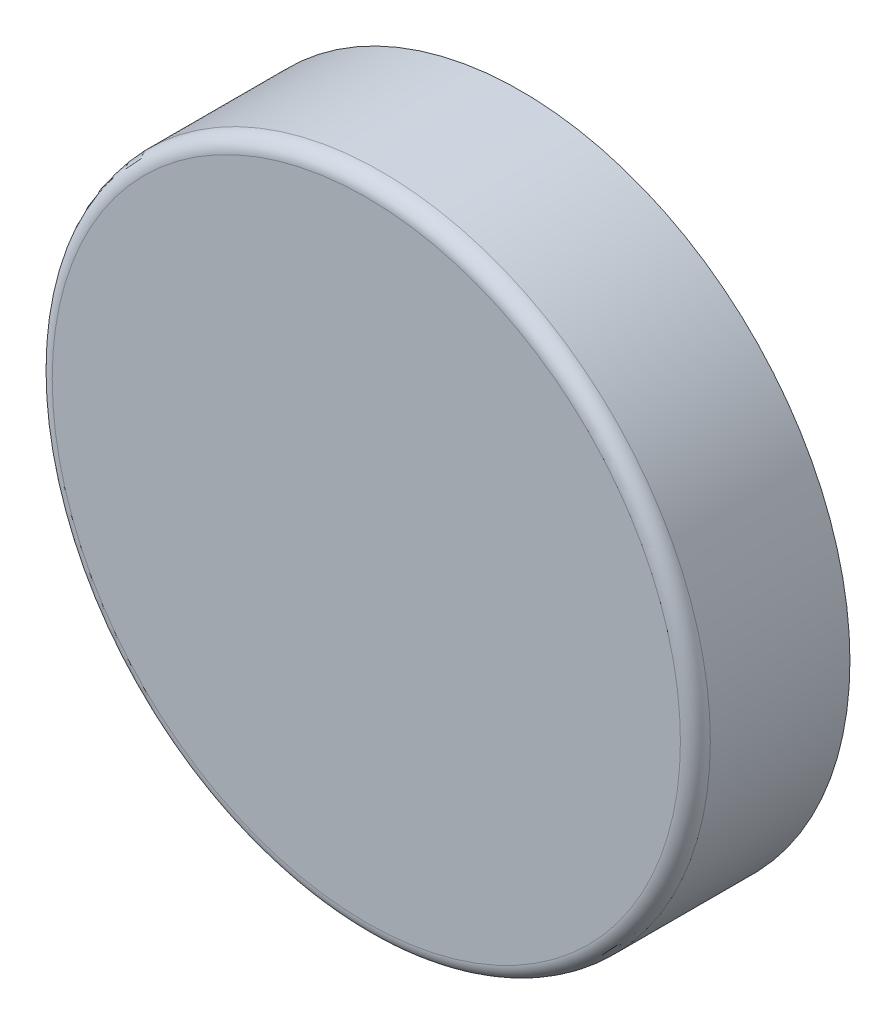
ISO-10303-21;
HEADER;
FILE_DESCRIPTION(('STEP AP214'),'2;1');
FILE_NAME('part.step','',(''),(''),'','','');
FILE_SCHEMA(('AUTOMOTIVE_DESIGN { 1 0 10303 214 1 1 1 1 }'));
ENDSEC;
DATA;
#1=APPLICATION_CONTEXT('core data for automotive mechanical design processes');
#2=APPLICATION_PROTOCOL_DEFINITION('international standard','automotive_design',2000,#1);
#3=PRODUCT_CONTEXT('',#1,'mechanical');
#4=PRODUCT('Part','Part','',(#3));
#5=PRODUCT_RELATED_PRODUCT_CATEGORY('part','',(#4));
#6=PRODUCT_DEFINITION_FORMATION('','',#4);
#7=PRODUCT_DEFINITION_CONTEXT('part definition',#1,'design');
#8=PRODUCT_DEFINITION('design','',#6,#7);
#9=PRODUCT_DEFINITION_SHAPE('','',#8);
#10=(LENGTH_UNIT() NAMED_UNIT(*) SI_UNIT(.MILLI.,.METRE.));
#11=(NAMED_UNIT(*) PLANE_ANGLE_UNIT() SI_UNIT($,.RADIAN.));
#12=(NAMED_UNIT(*) SI_UNIT($,.STERADIAN.) SOLID_ANGLE_UNIT());
#13=UNCERTAINTY_MEASURE_WITH_UNIT(LENGTH_MEASURE(1.E-05),#10,'distance_accuracy_value','');
#14=(GEOMETRIC_REPRESENTATION_CONTEXT(3) GLOBAL_UNCERTAINTY_ASSIGNED_CONTEXT((#13)) GLOBAL_UNIT_ASSIGNED_CONTEXT((#10,
#11,#12)) REPRESENTATION_CONTEXT('',''));
#15=CARTESIAN_POINT('',(0.,0.,0.));
#16=DIRECTION('',(0.,0.,1.));
#17=DIRECTION('',(1.,0.,0.));
#18=AXIS2_PLACEMENT_3D('',#15,#16,#17);
#19=CARTESIAN_POINT('',(0.,0.,3.1));
#20=DIRECTION('',(0.,0.,-1.));
#21=DIRECTION('',(-1.,0.,0.));
#22=AXIS2_PLACEMENT_3D('',#19,#20,#21);
#23=CYLINDRICAL_SURFACE('',#22,6.6);
#24=CARTESIAN_POINT('',(0.,0.,2.8));
#25=DIRECTION('',(0.,0.,1.));
#26=DIRECTION('',(1.,0.,0.));
#27=AXIS2_PLACEMENT_3D('',#24,#25,#26);
#28=CIRCLE('',#27,6.6);
#29=CARTESIAN_POINT('',(-6.6,0.,2.8));
#30=VERTEX_POINT('',#29);
#31=EDGE_CURVE('E10',#30,#30,#28,.F.);
#32=CARTESIAN_POINT('',(0.,0.,0.));
#33=DIRECTION('',(0.,0.,1.));
#34=DIRECTION('',(1.,0.,0.));
#35=AXIS2_PLACEMENT_3D('',#32,#33,#34);
#36=CIRCLE('',#35,6.6);
#37=CARTESIAN_POINT('',(-6.6,0.,0.));
#38=VERTEX_POINT('',#37);
#39=EDGE_CURVE('E42',#38,#38,#36,.T.);
#40=CARTESIAN_POINT('',(-6.6,0.,2.8));
#41=CARTESIAN_POINT('',(-6.6,0.,2.77083333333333));
#42=CARTESIAN_POINT('',(-6.6,0.,2.74166666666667));
#43=CARTESIAN_POINT('',(-6.6,0.,2.68333333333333));
#44=CARTESIAN_POINT('',(-6.6,0.,2.65416666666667));
#45=CARTESIAN_POINT('',(-6.6,0.,2.59583333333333));
#46=CARTESIAN_POINT('',(-6.6,0.,2.56666666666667));
#47=CARTESIAN_POINT('',(-6.6,0.,2.50833333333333));
#48=CARTESIAN_POINT('',(-6.6,0.,2.47916666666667));
#49=CARTESIAN_POINT('',(-6.6,0.,2.42083333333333));
#50=CARTESIAN_POINT('',(-6.6,0.,2.39166666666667));
#51=CARTESIAN_POINT('',(-6.6,0.,2.33333333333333));
#52=CARTESIAN_POINT('',(-6.6,0.,2.30416666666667));
#53=CARTESIAN_POINT('',(-6.6,0.,2.24583333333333));
#54=CARTESIAN_POINT('',(-6.6,0.,2.21666666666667));
#55=CARTESIAN_POINT('',(-6.6,0.,2.15833333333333));
#56=CARTESIAN_POINT('',(-6.6,0.,2.12916666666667));
#57=CARTESIAN_POINT('',(-6.6,0.,2.07083333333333));
#58=CARTESIAN_POINT('',(-6.6,0.,2.04166666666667));
#59=CARTESIAN_POINT('',(-6.6,0.,1.98333333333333));
#60=CARTESIAN_POINT('',(-6.6,0.,1.95416666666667));
#61=CARTESIAN_POINT('',(-6.6,0.,1.89583333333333));
#62=CARTESIAN_POINT('',(-6.6,0.,1.86666666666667));
#63=CARTESIAN_POINT('',(-6.6,0.,1.80833333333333));
#64=CARTESIAN_POINT('',(-6.6,0.,1.77916666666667));
#65=CARTESIAN_POINT('',(-6.6,0.,1.72083333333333));
#66=CARTESIAN_POINT('',(-6.6,0.,1.69166666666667));
#67=CARTESIAN_POINT('',(-6.6,0.,1.63333333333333));
#68=CARTESIAN_POINT('',(-6.6,0.,1.60416666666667));
#69=CARTESIAN_POINT('',(-6.6,0.,1.54583333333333));
#70=CARTESIAN_POINT('',(-6.6,0.,1.51666666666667));
#71=CARTESIAN_POINT('',(-6.6,0.,1.45833333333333));
#72=CARTESIAN_POINT('',(-6.6,0.,1.42916666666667));
#73=CARTESIAN_POINT('',(-6.6,0.,1.37083333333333));
#74=CARTESIAN_POINT('',(-6.6,0.,1.34166666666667));
#75=CARTESIAN_POINT('',(-6.6,0.,1.28333333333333));
#76=CARTESIAN_POINT('',(-6.6,0.,1.25416666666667));
#77=CARTESIAN_POINT('',(-6.6,0.,1.19583333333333));
#78=CARTESIAN_POINT('',(-6.6,0.,1.16666666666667));
#79=CARTESIAN_POINT('',(-6.6,0.,1.10833333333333));
#80=CARTESIAN_POINT('',(-6.6,0.,1.07916666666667));
#81=CARTESIAN_POINT('',(-6.6,0.,1.02083333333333));
#82=CARTESIAN_POINT('',(-6.6,0.,0.991666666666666));
#83=CARTESIAN_POINT('',(-6.6,0.,0.933333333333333));
#84=CARTESIAN_POINT('',(-6.6,0.,0.904166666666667));
#85=CARTESIAN_POINT('',(-6.6,0.,0.845833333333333));
#86=CARTESIAN_POINT('',(-6.6,0.,0.816666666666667));
#87=CARTESIAN_POINT('',(-6.6,0.,0.758333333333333));
#88=CARTESIAN_POINT('',(-6.6,0.,0.729166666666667));
#89=CARTESIAN_POINT('',(-6.6,0.,0.670833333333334));
#90=CARTESIAN_POINT('',(-6.6,0.,0.641666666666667));
#91=CARTESIAN_POINT('',(-6.6,0.,0.583333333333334));
#92=CARTESIAN_POINT('',(-6.6,0.,0.554166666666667));
#93=CARTESIAN_POINT('',(-6.6,0.,0.495833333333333));
#94=CARTESIAN_POINT('',(-6.6,0.,0.466666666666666));
#95=CARTESIAN_POINT('',(-6.6,0.,0.408333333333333));
#96=CARTESIAN_POINT('',(-6.6,0.,0.379166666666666));
#97=CARTESIAN_POINT('',(-6.6,0.,0.320833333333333));
#98=CARTESIAN_POINT('',(-6.6,0.,0.291666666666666));
#99=CARTESIAN_POINT('',(-6.6,0.,0.233333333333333));
#100=CARTESIAN_POINT('',(-6.6,0.,0.204166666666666));
#101=CARTESIAN_POINT('',(-6.6,0.,0.145833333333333));
#102=CARTESIAN_POINT('',(-6.6,0.,0.116666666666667));
#103=CARTESIAN_POINT('',(-6.6,0.,0.0583333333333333));
#104=CARTESIAN_POINT('',(-6.6,0.,0.0291666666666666));
#105=CARTESIAN_POINT('',(-6.6,0.,0.));
#106=B_SPLINE_CURVE_WITH_KNOTS('',3,(#40,#41,#42,#43,#44,#45,#46,#47,#48,#49,#50,#51,#52,#53,
#54,#55,#56,#57,#58,#59,#60,#61,#62,#63,#64,#65,#66,#67,#68,#69,#70,#71,#72,#73,#74,#75,#76,#77,
#78,#79,#80,#81,#82,#83,#84,#85,#86,#87,#88,#89,#90,#91,#92,#93,#94,#95,#96,#97,#98,#99,#100,
#101,#102,#103,#104,#105),.UNSPECIFIED.,.F.,.F.,(4,2,2,2,2,2,2,2,2,2,2,2,2,2,2,2,2,2,2,2,2,2,2,
2,2,2,2,2,2,2,2,2,4),(0.,0.0875000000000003,0.175,0.2625,0.35,0.4375,0.525,0.6125,0.7,0.7875,
0.875,0.9625,1.05,1.1375,1.225,1.3125,1.4,1.4875,1.575,1.6625,1.75,1.8375,1.925,2.0125,2.1,
2.1875,2.275,2.3625,2.45,2.5375,2.625,2.7125,2.8),.UNSPECIFIED.);
#107=EDGE_CURVE('BSEAM31',#30,#38,#106,.T.);
#108=ORIENTED_EDGE('',*,*,#31,.T.);
#109=ORIENTED_EDGE('',*,*,#39,.T.);
#110=ORIENTED_EDGE('',*,*,#107,.T.);
#111=ORIENTED_EDGE('',*,*,#107,.F.);
#112=EDGE_LOOP('',(#108,#110,#109,#111));
#113=FACE_BOUND('',#112,.T.);
#114=ADVANCED_FACE('F31',(#113),#23,.T.);
#115=CARTESIAN_POINT('',(0.,0.,3.1));
#116=DIRECTION('',(0.,0.,1.));
#117=DIRECTION('',(1.,0.,0.));
#118=AXIS2_PLACEMENT_3D('',#115,#116,#117);
#119=PLANE('',#118);
#120=CARTESIAN_POINT('',(0.,0.,3.1));
#121=DIRECTION('',(0.,0.,1.));
#122=DIRECTION('',(1.,0.,0.));
#123=AXIS2_PLACEMENT_3D('',#120,#121,#122);
#124=CIRCLE('',#123,6.3);
#125=CARTESIAN_POINT('',(6.3,0.,3.1));
#126=VERTEX_POINT('',#125);
#127=EDGE_CURVE('E38',#126,#126,#124,.T.);
#128=ORIENTED_EDGE('',*,*,#127,.T.);
#129=EDGE_LOOP('',(#128));
#130=FACE_BOUND('',#129,.T.);
#131=ADVANCED_FACE('F66',(#130),#119,.T.);
#132=CARTESIAN_POINT('',(0.,0.,0.));
#133=DIRECTION('',(0.,0.,1.));
#134=DIRECTION('',(1.,0.,0.));
#135=AXIS2_PLACEMENT_3D('',#132,#133,#134);
#136=PLANE('',#135);
#137=CARTESIAN_POINT('',(0.,0.,0.));
#138=DIRECTION('',(0.,0.,-1.));
#139=DIRECTION('',(-1.,0.,0.));
#140=AXIS2_PLACEMENT_3D('',#137,#138,#139);
#141=CIRCLE('',#140,5.95);
#142=CARTESIAN_POINT('',(-5.95,0.,0.));
#143=VERTEX_POINT('',#142);
#144=EDGE_CURVE('E49',#143,#143,#141,.T.);
#145=ORIENTED_EDGE('',*,*,#144,.F.);
#146=EDGE_LOOP('',(#145));
#147=FACE_BOUND('',#146,.T.);
#148=ORIENTED_EDGE('',*,*,#39,.F.);
#149=EDGE_LOOP('',(#148));
#150=FACE_BOUND('',#149,.T.);
#151=ADVANCED_FACE('F60',(#147,#150),#136,.F.);
#152=CARTESIAN_POINT('',(0.,0.,2.04));
#153=DIRECTION('',(0.,0.,-1.));
#154=DIRECTION('',(-1.,0.,0.));
#155=AXIS2_PLACEMENT_3D('',#152,#153,#154);
#156=CYLINDRICAL_SURFACE('',#155,5.95);
#157=CARTESIAN_POINT('',(0.,0.,2.04));
#158=DIRECTION('',(0.,0.,-1.));
#159=DIRECTION('',(-1.,0.,0.));
#160=AXIS2_PLACEMENT_3D('',#157,#158,#159);
#161=CIRCLE('',#160,5.95);
#162=CARTESIAN_POINT('',(-5.95,0.,2.04));
#163=VERTEX_POINT('',#162);
#164=EDGE_CURVE('E46',#163,#163,#161,.T.);
#165=ORIENTED_EDGE('',*,*,#164,.F.);
#166=EDGE_LOOP('',(#165));
#167=FACE_BOUND('',#166,.T.);
#168=ORIENTED_EDGE('',*,*,#144,.T.);
#169=EDGE_LOOP('',(#168));
#170=FACE_BOUND('',#169,.T.);
#171=ADVANCED_FACE('F57',(#167,#170),#156,.F.);
#172=CARTESIAN_POINT('',(0.,0.,2.04));
#173=DIRECTION('',(0.,0.,-1.));
#174=DIRECTION('',(-1.,0.,0.));
#175=AXIS2_PLACEMENT_3D('',#172,#173,#174);
#176=PLANE('',#175);
#177=ORIENTED_EDGE('',*,*,#164,.T.);
#178=EDGE_LOOP('',(#177));
#179=FACE_BOUND('',#178,.T.);
#180=ADVANCED_FACE('F55',(#179),#176,.T.);
#181=CARTESIAN_POINT('',(0.,0.,2.8));
#182=DIRECTION('',(0.,0.,1.));
#183=DIRECTION('',(1.,0.,0.));
#184=AXIS2_PLACEMENT_3D('',#181,#182,#183);
#185=TOROIDAL_SURFACE('',#184,6.3,0.3);
#186=ORIENTED_EDGE('',*,*,#31,.F.);
#187=EDGE_LOOP('',(#186));
#188=FACE_BOUND('',#187,.T.);
#189=ORIENTED_EDGE('',*,*,#127,.F.);
#190=EDGE_LOOP('',(#189));
#191=FACE_BOUND('',#190,.T.);
#192=ADVANCED_FACE('F33',(#188,#191),#185,.T.);
#193=CLOSED_SHELL('',(#114,#131,#151,#171,#180,#192));
#194=MANIFOLD_SOLID_BREP('B2',#193);
#195=ADVANCED_BREP_SHAPE_REPRESENTATION('',(#18,#194),#14);
#196=SHAPE_DEFINITION_REPRESENTATION(#9,#195);
ENDSEC;
END-ISO-10303-21;
